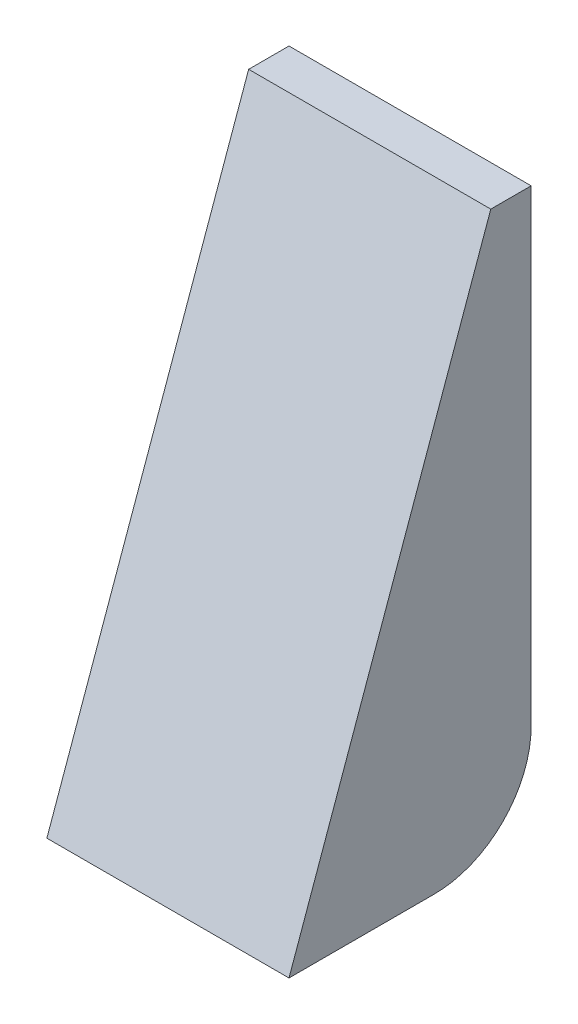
ISO-10303-21;
HEADER;
FILE_DESCRIPTION(('STEP AP214'),'2;1');
FILE_NAME('part.step','',(''),(''),'','','');
FILE_SCHEMA(('AUTOMOTIVE_DESIGN { 1 0 10303 214 1 1 1 1 }'));
ENDSEC;
DATA;
#1=APPLICATION_CONTEXT('core data for automotive mechanical design processes');
#2=APPLICATION_PROTOCOL_DEFINITION('international standard','automotive_design',2000,#1);
#3=PRODUCT_CONTEXT('',#1,'mechanical');
#4=PRODUCT('Part','Part','',(#3));
#5=PRODUCT_RELATED_PRODUCT_CATEGORY('part','',(#4));
#6=PRODUCT_DEFINITION_FORMATION('','',#4);
#7=PRODUCT_DEFINITION_CONTEXT('part definition',#1,'design');
#8=PRODUCT_DEFINITION('design','',#6,#7);
#9=PRODUCT_DEFINITION_SHAPE('','',#8);
#10=(LENGTH_UNIT() NAMED_UNIT(*) SI_UNIT(.MILLI.,.METRE.));
#11=(NAMED_UNIT(*) PLANE_ANGLE_UNIT() SI_UNIT($,.RADIAN.));
#12=(NAMED_UNIT(*) SI_UNIT($,.STERADIAN.) SOLID_ANGLE_UNIT());
#13=UNCERTAINTY_MEASURE_WITH_UNIT(LENGTH_MEASURE(1.E-05),#10,'distance_accuracy_value','');
#14=(GEOMETRIC_REPRESENTATION_CONTEXT(3) GLOBAL_UNCERTAINTY_ASSIGNED_CONTEXT((#13)) GLOBAL_UNIT_ASSIGNED_CONTEXT((#10,
#11,#12)) REPRESENTATION_CONTEXT('',''));
#15=CARTESIAN_POINT('',(0.,0.,0.));
#16=DIRECTION('',(0.,0.,1.));
#17=DIRECTION('',(1.,0.,0.));
#18=AXIS2_PLACEMENT_3D('',#15,#16,#17);
#19=CARTESIAN_POINT('',(0.,0.,15.));
#20=DIRECTION('',(1.,0.,0.));
#21=DIRECTION('',(0.,0.,-1.));
#22=AXIS2_PLACEMENT_3D('',#19,#20,#21);
#23=PLANE('',#22);
#24=DIRECTION('',(0.,-1.,0.));
#25=VECTOR('',#24,1.);
#26=CARTESIAN_POINT('',(0.,0.,0.));
#27=LINE('',#26,#25);
#28=CARTESIAN_POINT('',(0.,35.,0.));
#29=VERTEX_POINT('',#28);
#30=CARTESIAN_POINT('',(0.,6.,0.));
#31=VERTEX_POINT('',#30);
#32=EDGE_CURVE('E114',#29,#31,#27,.T.);
#33=ORIENTED_EDGE('',*,*,#32,.T.);
#34=CARTESIAN_POINT('',(0.,6.,6.));
#35=DIRECTION('',(1.,0.,0.));
#36=DIRECTION('',(0.,0.,-1.));
#37=AXIS2_PLACEMENT_3D('',#34,#35,#36);
#38=CIRCLE('',#37,6.);
#39=CARTESIAN_POINT('',(0.,0.,6.));
#40=VERTEX_POINT('',#39);
#41=EDGE_CURVE('E11',#31,#40,#38,.F.);
#42=ORIENTED_EDGE('',*,*,#41,.T.);
#43=DIRECTION('',(0.,0.,-1.));
#44=VECTOR('',#43,1.);
#45=CARTESIAN_POINT('',(0.,0.,15.));
#46=LINE('',#45,#44);
#47=CARTESIAN_POINT('',(0.,0.,15.));
#48=VERTEX_POINT('',#47);
#49=EDGE_CURVE('E102',#48,#40,#46,.T.);
#50=ORIENTED_EDGE('',*,*,#49,.F.);
#51=DIRECTION('',(0.,0.941741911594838,-0.336336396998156));
#52=VECTOR('',#51,1.);
#53=CARTESIAN_POINT('',(0.,0.,15.));
#54=LINE('',#53,#52);
#55=CARTESIAN_POINT('',(0.,35.,2.5));
#56=VERTEX_POINT('',#55);
#57=EDGE_CURVE('E84',#48,#56,#54,.T.);
#58=ORIENTED_EDGE('',*,*,#57,.T.);
#59=DIRECTION('',(0.,0.,-1.));
#60=VECTOR('',#59,1.);
#61=CARTESIAN_POINT('',(0.,35.,15.));
#62=LINE('',#61,#60);
#63=EDGE_CURVE('E89',#56,#29,#62,.T.);
#64=ORIENTED_EDGE('',*,*,#63,.T.);
#65=EDGE_LOOP('',(#33,#42,#50,#58,#64));
#66=FACE_BOUND('',#65,.T.);
#67=ADVANCED_FACE('F33',(#66),#23,.F.);
#68=CARTESIAN_POINT('',(15.,0.,15.));
#69=DIRECTION('',(-1.,0.,0.));
#70=DIRECTION('',(0.,0.,1.));
#71=AXIS2_PLACEMENT_3D('',#68,#69,#70);
#72=PLANE('',#71);
#73=DIRECTION('',(0.,0.,-1.));
#74=VECTOR('',#73,1.);
#75=CARTESIAN_POINT('',(15.,0.,15.));
#76=LINE('',#75,#74);
#77=CARTESIAN_POINT('',(15.,0.,15.));
#78=VERTEX_POINT('',#77);
#79=CARTESIAN_POINT('',(15.,0.,6.));
#80=VERTEX_POINT('',#79);
#81=EDGE_CURVE('E94',#78,#80,#76,.T.);
#82=ORIENTED_EDGE('',*,*,#81,.T.);
#83=CARTESIAN_POINT('',(15.,6.,6.));
#84=DIRECTION('',(-1.,0.,0.));
#85=DIRECTION('',(0.,0.,1.));
#86=AXIS2_PLACEMENT_3D('',#83,#84,#85);
#87=CIRCLE('',#86,6.);
#88=CARTESIAN_POINT('',(15.,6.,0.));
#89=VERTEX_POINT('',#88);
#90=EDGE_CURVE('E55',#80,#89,#87,.F.);
#91=ORIENTED_EDGE('',*,*,#90,.T.);
#92=DIRECTION('',(0.,1.,0.));
#93=VECTOR('',#92,1.);
#94=CARTESIAN_POINT('',(15.,0.,0.));
#95=LINE('',#94,#93);
#96=CARTESIAN_POINT('',(15.,35.,0.));
#97=VERTEX_POINT('',#96);
#98=EDGE_CURVE('E112',#89,#97,#95,.T.);
#99=ORIENTED_EDGE('',*,*,#98,.T.);
#100=DIRECTION('',(0.,0.,-1.));
#101=VECTOR('',#100,1.);
#102=CARTESIAN_POINT('',(15.,35.,15.));
#103=LINE('',#102,#101);
#104=CARTESIAN_POINT('',(15.,35.,2.5));
#105=VERTEX_POINT('',#104);
#106=EDGE_CURVE('E96',#105,#97,#103,.T.);
#107=ORIENTED_EDGE('',*,*,#106,.F.);
#108=DIRECTION('',(0.,-0.941741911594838,0.336336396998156));
#109=VECTOR('',#108,1.);
#110=CARTESIAN_POINT('',(15.,0.,15.));
#111=LINE('',#110,#109);
#112=EDGE_CURVE('E81',#105,#78,#111,.T.);
#113=ORIENTED_EDGE('',*,*,#112,.T.);
#114=EDGE_LOOP('',(#82,#91,#99,#107,#113));
#115=FACE_BOUND('',#114,.T.);
#116=ADVANCED_FACE('F93',(#115),#72,.F.);
#117=CARTESIAN_POINT('',(0.,35.,15.));
#118=DIRECTION('',(0.,-1.,0.));
#119=DIRECTION('',(0.,0.,-1.));
#120=AXIS2_PLACEMENT_3D('',#117,#118,#119);
#121=PLANE('',#120);
#122=DIRECTION('',(1.,0.,0.));
#123=VECTOR('',#122,1.);
#124=CARTESIAN_POINT('',(15.,35.,2.5));
#125=LINE('',#124,#123);
#126=EDGE_CURVE('E115',#56,#105,#125,.T.);
#127=ORIENTED_EDGE('',*,*,#126,.T.);
#128=ORIENTED_EDGE('',*,*,#106,.T.);
#129=DIRECTION('',(-1.,0.,0.));
#130=VECTOR('',#129,1.);
#131=CARTESIAN_POINT('',(0.,35.,0.));
#132=LINE('',#131,#130);
#133=EDGE_CURVE('E90',#97,#29,#132,.T.);
#134=ORIENTED_EDGE('',*,*,#133,.T.);
#135=ORIENTED_EDGE('',*,*,#63,.F.);
#136=EDGE_LOOP('',(#127,#128,#134,#135));
#137=FACE_BOUND('',#136,.T.);
#138=ADVANCED_FACE('F121',(#137),#121,.F.);
#139=CARTESIAN_POINT('',(0.,0.,15.));
#140=DIRECTION('',(0.,1.,0.));
#141=DIRECTION('',(0.,0.,1.));
#142=AXIS2_PLACEMENT_3D('',#139,#140,#141);
#143=PLANE('',#142);
#144=ORIENTED_EDGE('',*,*,#49,.T.);
#145=DIRECTION('',(1.,0.,0.));
#146=VECTOR('',#145,1.);
#147=CARTESIAN_POINT('',(15.,0.,6.));
#148=LINE('',#147,#146);
#149=EDGE_CURVE('E101',#40,#80,#148,.T.);
#150=ORIENTED_EDGE('',*,*,#149,.T.);
#151=ORIENTED_EDGE('',*,*,#81,.F.);
#152=DIRECTION('',(1.,0.,0.));
#153=VECTOR('',#152,1.);
#154=CARTESIAN_POINT('',(0.,0.,15.));
#155=LINE('',#154,#153);
#156=EDGE_CURVE('E78',#48,#78,#155,.T.);
#157=ORIENTED_EDGE('',*,*,#156,.F.);
#158=EDGE_LOOP('',(#144,#150,#151,#157));
#159=FACE_BOUND('',#158,.T.);
#160=ADVANCED_FACE('F99',(#159),#143,.F.);
#161=CARTESIAN_POINT('',(0.,0.,0.));
#162=DIRECTION('',(0.,0.,-1.));
#163=DIRECTION('',(-1.,0.,0.));
#164=AXIS2_PLACEMENT_3D('',#161,#162,#163);
#165=PLANE('',#164);
#166=ORIENTED_EDGE('',*,*,#98,.F.);
#167=DIRECTION('',(1.,0.,0.));
#168=VECTOR('',#167,1.);
#169=CARTESIAN_POINT('',(0.,6.,0.));
#170=LINE('',#169,#168);
#171=EDGE_CURVE('E41',#89,#31,#170,.F.);
#172=ORIENTED_EDGE('',*,*,#171,.T.);
#173=ORIENTED_EDGE('',*,*,#32,.F.);
#174=ORIENTED_EDGE('',*,*,#133,.F.);
#175=EDGE_LOOP('',(#166,#172,#173,#174));
#176=FACE_BOUND('',#175,.T.);
#177=ADVANCED_FACE('F123',(#176),#165,.T.);
#178=CARTESIAN_POINT('',(0.,4.75113122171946,13.3031674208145));
#179=DIRECTION('',(0.,0.336336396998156,0.941741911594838));
#180=DIRECTION('',(0.,-0.941741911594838,0.336336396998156));
#181=AXIS2_PLACEMENT_3D('',#178,#179,#180);
#182=PLANE('',#181);
#183=ORIENTED_EDGE('',*,*,#112,.F.);
#184=ORIENTED_EDGE('',*,*,#126,.F.);
#185=ORIENTED_EDGE('',*,*,#57,.F.);
#186=ORIENTED_EDGE('',*,*,#156,.T.);
#187=EDGE_LOOP('',(#183,#184,#185,#186));
#188=FACE_BOUND('',#187,.T.);
#189=ADVANCED_FACE('F80',(#188),#182,.T.);
#190=CARTESIAN_POINT('',(0.,6.,6.));
#191=DIRECTION('',(-1.,0.,0.));
#192=DIRECTION('',(0.,0.,1.));
#193=AXIS2_PLACEMENT_3D('',#190,#191,#192);
#194=CYLINDRICAL_SURFACE('',#193,6.);
#195=ORIENTED_EDGE('',*,*,#41,.F.);
#196=ORIENTED_EDGE('',*,*,#171,.F.);
#197=ORIENTED_EDGE('',*,*,#90,.F.);
#198=ORIENTED_EDGE('',*,*,#149,.F.);
#199=EDGE_LOOP('',(#195,#196,#197,#198));
#200=FACE_BOUND('',#199,.T.);
#201=ADVANCED_FACE('F35',(#200),#194,.T.);
#202=CLOSED_SHELL('',(#67,#116,#138,#160,#177,#189,#201));
#203=MANIFOLD_SOLID_BREP('B2',#202);
#204=ADVANCED_BREP_SHAPE_REPRESENTATION('',(#18,#203),#14);
#205=SHAPE_DEFINITION_REPRESENTATION(#9,#204);
ENDSEC;
END-ISO-10303-21;
